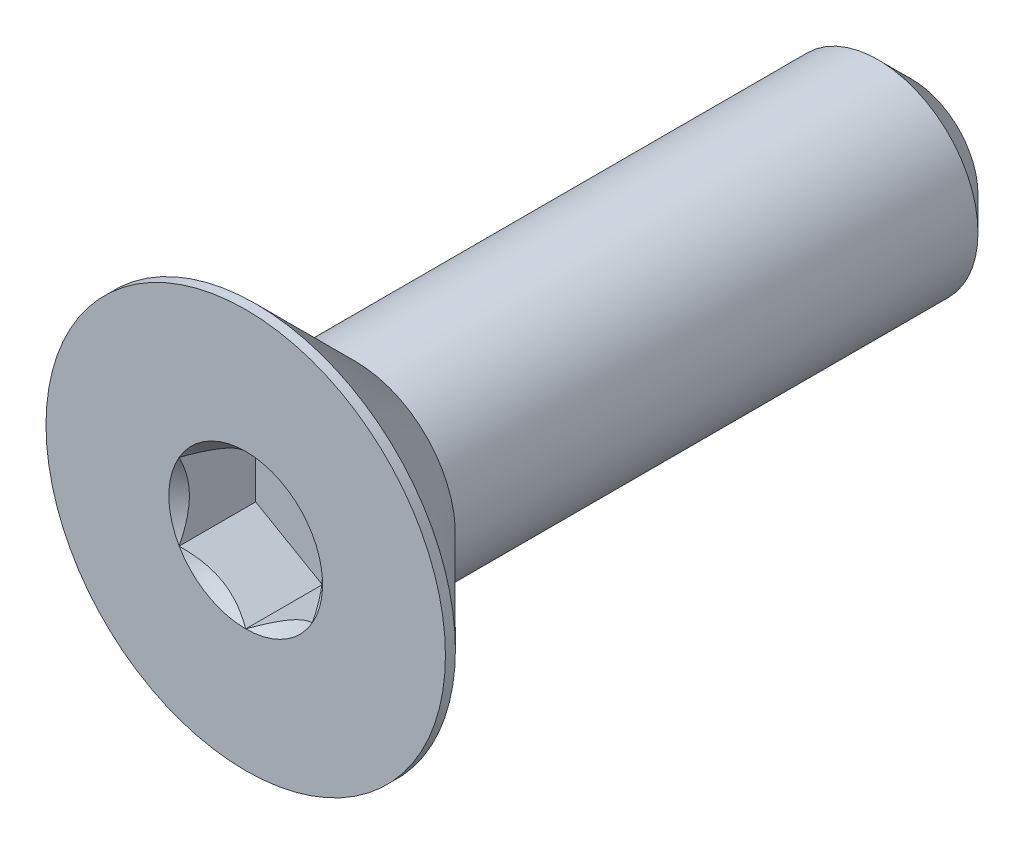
ISO-10303-21;
HEADER;
FILE_DESCRIPTION(('STEP AP214'),'2;1');
FILE_NAME('part.step','',(''),(''),'','','');
FILE_SCHEMA(('AUTOMOTIVE_DESIGN { 1 0 10303 214 1 1 1 1 }'));
ENDSEC;
DATA;
#1=APPLICATION_CONTEXT('core data for automotive mechanical design processes');
#2=APPLICATION_PROTOCOL_DEFINITION('international standard','automotive_design',2000,#1);
#3=PRODUCT_CONTEXT('',#1,'mechanical');
#4=PRODUCT('Part','Part','',(#3));
#5=PRODUCT_RELATED_PRODUCT_CATEGORY('part','',(#4));
#6=PRODUCT_DEFINITION_FORMATION('','',#4);
#7=PRODUCT_DEFINITION_CONTEXT('part definition',#1,'design');
#8=PRODUCT_DEFINITION('design','',#6,#7);
#9=PRODUCT_DEFINITION_SHAPE('','',#8);
#10=(LENGTH_UNIT() NAMED_UNIT(*) SI_UNIT(.MILLI.,.METRE.));
#11=(NAMED_UNIT(*) PLANE_ANGLE_UNIT() SI_UNIT($,.RADIAN.));
#12=(NAMED_UNIT(*) SI_UNIT($,.STERADIAN.) SOLID_ANGLE_UNIT());
#13=UNCERTAINTY_MEASURE_WITH_UNIT(LENGTH_MEASURE(1.E-05),#10,'distance_accuracy_value','');
#14=(GEOMETRIC_REPRESENTATION_CONTEXT(3) GLOBAL_UNCERTAINTY_ASSIGNED_CONTEXT((#13)) GLOBAL_UNIT_ASSIGNED_CONTEXT((#10,
#11,#12)) REPRESENTATION_CONTEXT('',''));
#15=CARTESIAN_POINT('',(0.,0.,0.));
#16=DIRECTION('',(0.,0.,1.));
#17=DIRECTION('',(1.,0.,0.));
#18=AXIS2_PLACEMENT_3D('',#15,#16,#17);
#19=CARTESIAN_POINT('',(0.,0.,-3.300000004));
#20=DIRECTION('',(0.,0.,-1.));
#21=DIRECTION('',(-1.,0.,0.));
#22=AXIS2_PLACEMENT_3D('',#19,#20,#21);
#23=CYLINDRICAL_SURFACE('',#22,2.9999999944);
#24=CARTESIAN_POINT('',(0.,0.,-19.0000000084));
#25=DIRECTION('',(0.,0.,1.));
#26=DIRECTION('',(1.,0.,0.));
#27=AXIS2_PLACEMENT_3D('',#24,#25,#26);
#28=CIRCLE('',#27,2.9999999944);
#29=CARTESIAN_POINT('',(2.9999999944,0.,-19.0000000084));
#30=VERTEX_POINT('',#29);
#31=EDGE_CURVE('E22',#30,#30,#28,.T.);
#32=ORIENTED_EDGE('',*,*,#31,.T.);
#33=EDGE_LOOP('',(#32));
#34=FACE_BOUND('',#33,.T.);
#35=CARTESIAN_POINT('',(0.,0.,-3.30000000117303));
#36=DIRECTION('',(0.,0.,1.));
#37=DIRECTION('',(0.,-1.,0.));
#38=AXIS2_PLACEMENT_3D('',#35,#36,#37);
#39=CIRCLE('',#38,2.99999999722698);
#40=CARTESIAN_POINT('',(0.,-2.99999999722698,-3.30000000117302));
#41=VERTEX_POINT('',#40);
#42=EDGE_CURVE('E112',#41,#41,#39,.F.);
#43=ORIENTED_EDGE('',*,*,#42,.T.);
#44=EDGE_LOOP('',(#43));
#45=FACE_BOUND('',#44,.T.);
#46=ADVANCED_FACE('F14',(#34,#45),#23,.T.);
#47=CARTESIAN_POINT('',(1.9999999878,-1.1547005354,-2.3100000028));
#48=DIRECTION('',(1.,0.,0.));
#49=DIRECTION('',(0.,1.,0.));
#50=AXIS2_PLACEMENT_3D('',#47,#48,#49);
#51=PLANE('',#50);
#52=DIRECTION('',(0.,0.,-1.));
#53=VECTOR('',#52,1.);
#54=CARTESIAN_POINT('',(1.9999999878,1.1547005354,-1.1480700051));
#55=LINE('',#54,#53);
#56=CARTESIAN_POINT('',(1.99999999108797,1.1547005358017,-3.04831647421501E-09));
#57=VERTEX_POINT('',#56);
#58=CARTESIAN_POINT('',(1.9999999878,1.1547005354,-2.3000000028));
#59=VERTEX_POINT('',#58);
#60=EDGE_CURVE('E92',#57,#59,#55,.T.);
#61=ORIENTED_EDGE('',*,*,#60,.T.);
#62=DIRECTION('',(0.,1.,0.));
#63=VECTOR('',#62,1.);
#64=CARTESIAN_POINT('',(1.9999999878,-1.1547005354,-2.3000000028));
#65=LINE('',#64,#63);
#66=CARTESIAN_POINT('',(1.9999999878,-1.1547005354,-2.3000000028));
#67=VERTEX_POINT('',#66);
#68=EDGE_CURVE('E29',#67,#59,#65,.T.);
#69=ORIENTED_EDGE('',*,*,#68,.F.);
#70=DIRECTION('',(0.,0.,1.));
#71=VECTOR('',#70,1.);
#72=CARTESIAN_POINT('',(1.9999999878,-1.1547005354,-1.1480700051));
#73=LINE('',#72,#71);
#74=CARTESIAN_POINT('',(1.99999999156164,-1.15470053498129,-3.04831648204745E-09));
#75=VERTEX_POINT('',#74);
#76=EDGE_CURVE('E111',#67,#75,#73,.T.);
#77=ORIENTED_EDGE('',*,*,#76,.T.);
#78=CARTESIAN_POINT('',(1.9999999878,1.15470053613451,-5.7293805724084E-09));
#79=CARTESIAN_POINT('',(1.99999998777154,1.07584383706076,-0.039391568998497));
#80=CARTESIAN_POINT('',(1.99999998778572,0.995677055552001,-0.0764830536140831));
#81=CARTESIAN_POINT('',(1.99999998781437,0.832178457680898,-0.144472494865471));
#82=CARTESIAN_POINT('',(1.99999998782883,0.7488296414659,-0.175329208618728));
#83=CARTESIAN_POINT('',(1.99999998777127,0.579723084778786,-0.228612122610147));
#84=CARTESIAN_POINT('',(1.99999998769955,0.493974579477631,-0.251066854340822));
#85=CARTESIAN_POINT('',(1.99999998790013,0.320597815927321,-0.28563688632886));
#86=CARTESIAN_POINT('',(1.99999998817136,0.232976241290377,-0.297784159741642));
#87=CARTESIAN_POINT('',(1.99999998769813,0.120862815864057,-0.305898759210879));
#88=CARTESIAN_POINT('',(1.99999998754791,0.0967023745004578,-0.307210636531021));
#89=CARTESIAN_POINT('',(1.99999998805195,0.0483624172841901,-0.308961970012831));
#90=CARTESIAN_POINT('',(1.99999998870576,0.0241829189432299,-0.309401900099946));
#91=CARTESIAN_POINT('',(1.99999998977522,-0.0606943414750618,-0.309399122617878));
#92=CARTESIAN_POINT('',(1.99999998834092,-0.121410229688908,-0.306620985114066));
#93=CARTESIAN_POINT('',(1.99999998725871,-0.242368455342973,-0.295673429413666));
#94=CARTESIAN_POINT('',(1.99999998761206,-0.302610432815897,-0.287500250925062));
#95=CARTESIAN_POINT('',(1.99999998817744,-0.482533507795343,-0.255399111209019));
#96=CARTESIAN_POINT('',(1.99999998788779,-0.600903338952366,-0.223894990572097));
#97=CARTESIAN_POINT('',(1.99999998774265,-0.792109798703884,-0.159445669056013));
#98=CARTESIAN_POINT('',(1.99999998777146,-0.866504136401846,-0.130787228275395));
#99=CARTESIAN_POINT('',(1.99999998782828,-1.01247590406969,-0.068675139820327));
#100=CARTESIAN_POINT('',(1.9999999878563,-1.08407287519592,-0.0352677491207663));
#101=CARTESIAN_POINT('',(1.9999999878,-1.15470053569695,-5.9481570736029E-09));
#102=B_SPLINE_CURVE_WITH_KNOTS('',3,(#78,#79,#80,#81,#82,#83,#84,#85,#86,#87,#88,#89,#90,#91,
#92,#93,#94,#95,#96,#97,#98,#99,#100,#101),.UNSPECIFIED.,.F.,.F.,(4,2,2,2,2,2,2,2,2,2,2,4),(0.,
0.264626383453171,0.53094975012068,0.796360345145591,1.06094461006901,1.13352180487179,
1.20605954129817,1.38811490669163,1.57029729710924,1.93616710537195,2.17518491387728,
2.41201654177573),.UNSPECIFIED.);
#103=EDGE_CURVE('E37',#57,#75,#102,.T.);
#104=ORIENTED_EDGE('',*,*,#103,.F.);
#105=EDGE_LOOP('',(#61,#69,#77,#104));
#106=FACE_BOUND('',#105,.T.);
#107=ADVANCED_FACE('F210',(#106),#51,.F.);
#108=CARTESIAN_POINT('',(0.,0.,-3.6847226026));
#109=DIRECTION('',(0.,0.,1.));
#110=DIRECTION('',(1.,0.,0.));
#111=AXIS2_PLACEMENT_3D('',#108,#109,#110);
#112=CONICAL_SURFACE('',#111,2.6152773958,0.785398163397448);
#113=ORIENTED_EDGE('',*,*,#42,.F.);
#114=EDGE_LOOP('',(#113));
#115=FACE_BOUND('',#114,.T.);
#116=CARTESIAN_POINT('',(0.,0.,-0.3000000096));
#117=DIRECTION('',(0.,0.,1.));
#118=DIRECTION('',(0.,-1.,0.));
#119=AXIS2_PLACEMENT_3D('',#116,#117,#118);
#120=CIRCLE('',#119,5.9999999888);
#121=CARTESIAN_POINT('',(0.,-5.9999999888,-0.3000000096));
#122=VERTEX_POINT('',#121);
#123=EDGE_CURVE('E257',#122,#122,#120,.F.);
#124=ORIENTED_EDGE('',*,*,#123,.T.);
#125=EDGE_LOOP('',(#124));
#126=FACE_BOUND('',#125,.T.);
#127=ADVANCED_FACE('F216',(#115,#126),#112,.T.);
#128=CARTESIAN_POINT('',(0.,-2.3094010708,-2.3100000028));
#129=DIRECTION('',(0.50000000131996,-0.86602540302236,0.));
#130=DIRECTION('',(0.86602540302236,0.50000000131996,0.));
#131=AXIS2_PLACEMENT_3D('',#128,#129,#130);
#132=PLANE('',#131);
#133=ORIENTED_EDGE('',*,*,#76,.F.);
#134=DIRECTION('',(0.86602540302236,0.50000000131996,0.));
#135=VECTOR('',#134,1.);
#136=CARTESIAN_POINT('',(0.,-2.3094010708,-2.3000000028));
#137=LINE('',#136,#135);
#138=CARTESIAN_POINT('',(0.,-2.3094010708,-2.3000000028));
#139=VERTEX_POINT('',#138);
#140=EDGE_CURVE('E265',#139,#67,#137,.T.);
#141=ORIENTED_EDGE('',*,*,#140,.F.);
#142=DIRECTION('',(0.,0.,1.));
#143=VECTOR('',#142,1.);
#144=CARTESIAN_POINT('',(0.,-2.3094010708,-1.1480700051));
#145=LINE('',#144,#143);
#146=CARTESIAN_POINT('',(-2.94942066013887E-10,-2.30940107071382,-8.61750524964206E-11));
#147=VERTEX_POINT('',#146);
#148=EDGE_CURVE('E94',#139,#147,#145,.T.);
#149=ORIENTED_EDGE('',*,*,#148,.T.);
#150=CARTESIAN_POINT('',(1.99999999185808,-1.15470053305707,-3.75370075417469E-09));
#151=CARTESIAN_POINT('',(1.93125902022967,-1.19438815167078,-0.0396495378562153));
#152=CARTESIAN_POINT('',(1.8613686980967,-1.23473934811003,-0.0769700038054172));
#153=CARTESIAN_POINT('',(1.71885515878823,-1.31701957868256,-0.14530218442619));
#154=CARTESIAN_POINT('',(1.6462183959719,-1.35895643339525,-0.176275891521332));
#155=CARTESIAN_POINT('',(1.49974992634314,-1.44352004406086,-0.229334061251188));
#156=CARTESIAN_POINT('',(1.4259555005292,-1.4861252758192,-0.251551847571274));
#157=CARTESIAN_POINT('',(1.2767425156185,-1.57227343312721,-0.285782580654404));
#158=CARTESIAN_POINT('',(1.20132851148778,-1.61581372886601,-0.297821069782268));
#159=CARTESIAN_POINT('',(1.07134900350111,-1.69085743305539,-0.308683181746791));
#160=CARTESIAN_POINT('',(1.01695130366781,-1.72226395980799,-0.310290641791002));
#161=CARTESIAN_POINT('',(0.90824490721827,-1.78502562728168,-0.307579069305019));
#162=CARTESIAN_POINT('',(0.85393624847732,-1.81638074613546,-0.303257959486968));
#163=CARTESIAN_POINT('',(0.745831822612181,-1.87879486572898,-0.288935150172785));
#164=CARTESIAN_POINT('',(0.692036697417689,-1.90985349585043,-0.278927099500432));
#165=CARTESIAN_POINT('',(0.585376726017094,-1.97143365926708,-0.253779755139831));
#166=CARTESIAN_POINT('',(0.532511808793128,-2.00195523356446,-0.23864085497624));
#167=CARTESIAN_POINT('',(0.397133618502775,-2.08011586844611,-0.193708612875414));
#168=CARTESIAN_POINT('',(0.315458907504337,-2.12727078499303,-0.160532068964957));
#169=CARTESIAN_POINT('',(0.195362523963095,-2.19660846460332,-0.104527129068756));
#170=CARTESIAN_POINT('',(0.155785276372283,-2.21945839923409,-0.0848498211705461));
#171=CARTESIAN_POINT('',(0.0773635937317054,-2.2647351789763,-0.0437017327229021));
#172=CARTESIAN_POINT('',(0.0385187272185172,-2.28716227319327,-0.0222320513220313));
#173=CARTESIAN_POINT('',(2.98519060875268E-10,-2.30940107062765,-1.7235013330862E-10));
#174=B_SPLINE_CURVE_WITH_KNOTS('',3,(#150,#151,#152,#153,#154,#155,#156,#157,#158,#159,#160,
#161,#162,#163,#164,#165,#166,#167,#168,#169,#170,#171,#172,#173),.UNSPECIFIED.,.F.,.F.,(4,2,2,
2,2,2,2,2,2,2,2,4),(0.,0.266365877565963,0.534283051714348,0.797946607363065,1.0609465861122,
1.24918064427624,1.43748067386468,1.62599141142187,1.81448769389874,2.11378539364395,
2.26302826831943,2.41218028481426),.UNSPECIFIED.);
#175=EDGE_CURVE('E258',#75,#147,#174,.T.);
#176=ORIENTED_EDGE('',*,*,#175,.F.);
#177=EDGE_LOOP('',(#133,#141,#149,#176));
#178=FACE_BOUND('',#177,.T.);
#179=ADVANCED_FACE('F246',(#178),#132,.F.);
#180=CARTESIAN_POINT('',(-1.9999999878,-1.1547005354,-2.3100000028));
#181=DIRECTION('',(-0.50000000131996,-0.86602540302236,0.));
#182=DIRECTION('',(0.86602540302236,-0.50000000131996,0.));
#183=AXIS2_PLACEMENT_3D('',#180,#181,#182);
#184=PLANE('',#183);
#185=ORIENTED_EDGE('',*,*,#148,.F.);
#186=DIRECTION('',(0.866025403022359,-0.50000000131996,0.));
#187=VECTOR('',#186,1.);
#188=CARTESIAN_POINT('',(-1.9999999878,-1.1547005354,-2.3000000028));
#189=LINE('',#188,#187);
#190=CARTESIAN_POINT('',(-1.9999999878,-1.1547005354,-2.3000000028));
#191=VERTEX_POINT('',#190);
#192=EDGE_CURVE('E83',#191,#139,#189,.T.);
#193=ORIENTED_EDGE('',*,*,#192,.F.);
#194=DIRECTION('',(0.,0.,1.));
#195=VECTOR('',#194,1.);
#196=CARTESIAN_POINT('',(-1.9999999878,-1.1547005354,-1.1480700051));
#197=LINE('',#196,#195);
#198=CARTESIAN_POINT('',(-1.99999999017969,-1.15470054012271,-1.67439864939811E-09));
#199=VERTEX_POINT('',#198);
#200=EDGE_CURVE('E82',#191,#199,#197,.T.);
#201=ORIENTED_EDGE('',*,*,#200,.T.);
#202=CARTESIAN_POINT('',(-5.35426552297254E-10,-2.30940107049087,-3.09128858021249E-10));
#203=CARTESIAN_POINT('',(-0.0687409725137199,-2.26971345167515,-0.0396495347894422));
#204=CARTESIAN_POINT('',(-0.13863129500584,-2.22936225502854,-0.076970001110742));
#205=CARTESIAN_POINT('',(-0.281144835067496,-2.14708202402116,-0.145302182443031));
#206=CARTESIAN_POINT('',(-0.353781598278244,-2.10514516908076,-0.176275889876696));
#207=CARTESIAN_POINT('',(-0.50025006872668,-2.02058155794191,-0.229334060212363));
#208=CARTESIAN_POINT('',(-0.574044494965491,-1.97797632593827,-0.251551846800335));
#209=CARTESIAN_POINT('',(-0.723257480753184,-1.89182816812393,-0.285782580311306));
#210=CARTESIAN_POINT('',(-0.798671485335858,-1.84828787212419,-0.297821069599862));
#211=CARTESIAN_POINT('',(-0.928650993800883,-1.77324416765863,-0.308683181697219));
#212=CARTESIAN_POINT('',(-0.983048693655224,-1.74183764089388,-0.31029064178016));
#213=CARTESIAN_POINT('',(-1.0917550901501,-1.67907597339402,-0.307579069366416));
#214=CARTESIAN_POINT('',(-1.14606374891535,-1.64772085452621,-0.303257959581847));
#215=CARTESIAN_POINT('',(-1.25416817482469,-1.58530673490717,-0.288935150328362));
#216=CARTESIAN_POINT('',(-1.30796330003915,-1.55424810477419,-0.278927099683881));
#217=CARTESIAN_POINT('',(-1.41462327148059,-1.49266794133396,-0.253779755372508));
#218=CARTESIAN_POINT('',(-1.46748818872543,-1.46214636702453,-0.238640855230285));
#219=CARTESIAN_POINT('',(-1.60286637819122,-1.38398573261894,-0.193708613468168));
#220=CARTESIAN_POINT('',(-1.68454108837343,-1.33683081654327,-0.160532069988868));
#221=CARTESIAN_POINT('',(-1.80463747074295,-1.26749313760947,-0.104527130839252));
#222=CARTESIAN_POINT('',(-1.84421471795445,-1.2446432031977,-0.0848498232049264));
#223=CARTESIAN_POINT('',(-1.92263639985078,-1.19936642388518,-0.0437017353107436));
#224=CARTESIAN_POINT('',(-1.96148126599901,-1.17693932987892,-0.0222320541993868));
#225=CARTESIAN_POINT('',(-1.99999999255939,-1.15470053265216,-3.34879712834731E-09));
#226=B_SPLINE_CURVE_WITH_KNOTS('',3,(#202,#203,#204,#205,#206,#207,#208,#209,#210,#211,#212,
#213,#214,#215,#216,#217,#218,#219,#220,#221,#222,#223,#224,#225),.UNSPECIFIED.,.F.,.F.,(4,2,2,
2,2,2,2,2,2,2,2,4),(0.,0.266365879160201,0.534283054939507,0.797946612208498,1.06094659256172,
1.24918065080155,1.43748068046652,1.62599141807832,1.81448770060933,2.11378539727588,
2.26302827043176,2.41218028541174),.UNSPECIFIED.);
#227=EDGE_CURVE('E188',#147,#199,#226,.T.);
#228=ORIENTED_EDGE('',*,*,#227,.F.);
#229=EDGE_LOOP('',(#185,#193,#201,#228));
#230=FACE_BOUND('',#229,.T.);
#231=ADVANCED_FACE('F197',(#230),#184,.F.);
#232=CARTESIAN_POINT('',(-1.9999999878,1.1547005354,-2.3100000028));
#233=DIRECTION('',(-1.,0.,0.));
#234=DIRECTION('',(0.,-1.,0.));
#235=AXIS2_PLACEMENT_3D('',#232,#233,#234);
#236=PLANE('',#235);
#237=ORIENTED_EDGE('',*,*,#200,.F.);
#238=DIRECTION('',(0.,-1.,0.));
#239=VECTOR('',#238,1.);
#240=CARTESIAN_POINT('',(-1.9999999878,1.1547005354,-2.3000000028));
#241=LINE('',#240,#239);
#242=CARTESIAN_POINT('',(-1.9999999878,1.1547005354,-2.3000000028));
#243=VERTEX_POINT('',#242);
#244=EDGE_CURVE('E69',#243,#191,#241,.T.);
#245=ORIENTED_EDGE('',*,*,#244,.F.);
#246=DIRECTION('',(0.,0.,1.));
#247=VECTOR('',#246,1.);
#248=CARTESIAN_POINT('',(-1.9999999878,1.1547005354,-1.1480700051));
#249=LINE('',#248,#247);
#250=CARTESIAN_POINT('',(-1.99999999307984,1.15470053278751,-2.83040169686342E-09));
#251=VERTEX_POINT('',#250);
#252=EDGE_CURVE('E80',#243,#251,#249,.T.);
#253=ORIENTED_EDGE('',*,*,#252,.T.);
#254=CARTESIAN_POINT('',(-1.9999999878,-1.15470053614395,-5.72465599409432E-09));
#255=CARTESIAN_POINT('',(-1.9999999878,-1.07532529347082,-0.0396495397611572));
#256=CARTESIAN_POINT('',(-1.9999999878,-0.994622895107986,-0.0769700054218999));
#257=CARTESIAN_POINT('',(-1.9999999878,-0.830062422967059,-0.14530218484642));
#258=CARTESIAN_POINT('',(-1.9999999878,-0.746188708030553,-0.176275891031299));
#259=CARTESIAN_POINT('',(-1.9999999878,-0.577061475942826,-0.229334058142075));
#260=CARTESIAN_POINT('',(-1.9999999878,-0.491851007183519,-0.251551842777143));
#261=CARTESIAN_POINT('',(-1.9999999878,-0.319554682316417,-0.285782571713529));
#262=CARTESIAN_POINT('',(-1.9999999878,-0.232474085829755,-0.297821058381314));
#263=CARTESIAN_POINT('',(-1.9999999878,-0.0823866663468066,-0.308683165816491));
#264=CARTESIAN_POINT('',(-1.9999999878,-0.0195736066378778,-0.310290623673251));
#265=CARTESIAN_POINT('',(-1.9999999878,0.105949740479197,-0.307579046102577));
#266=CARTESIAN_POINT('',(-1.9999999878,0.168659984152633,-0.303257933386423));
#267=CARTESIAN_POINT('',(-1.9999999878,0.293488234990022,-0.288935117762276));
#268=CARTESIAN_POINT('',(-1.9999999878,0.355605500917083,-0.278927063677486));
#269=CARTESIAN_POINT('',(-1.9999999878,0.478765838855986,-0.253779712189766));
#270=CARTESIAN_POINT('',(-1.9999999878,0.539808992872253,-0.238640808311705));
#271=CARTESIAN_POINT('',(-1.9999999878,0.696130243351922,-0.193708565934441));
#272=CARTESIAN_POINT('',(-1.9999999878,0.790440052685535,-0.160532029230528));
#273=CARTESIAN_POINT('',(-1.9999999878,0.929115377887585,-0.104527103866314));
#274=CARTESIAN_POINT('',(-1.9999999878,0.974815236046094,-0.0848498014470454));
#275=CARTESIAN_POINT('',(-1.9999999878,1.06536877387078,-0.0437017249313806));
#276=CARTESIAN_POINT('',(-1.9999999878,1.11022295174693,-0.0222320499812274));
#277=CARTESIAN_POINT('',(-1.9999999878,1.15470053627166,-5.660802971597E-09));
#278=B_SPLINE_CURVE_WITH_KNOTS('',3,(#254,#255,#256,#257,#258,#259,#260,#261,#262,#263,#264,
#265,#266,#267,#268,#269,#270,#271,#272,#273,#274,#275,#276,#277),.UNSPECIFIED.,.F.,.F.,(4,2,2,
2,2,2,2,2,2,2,2,4),(0.,0.266365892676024,0.534283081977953,0.79794665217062,1.06094664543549,
1.24918072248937,1.43748077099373,1.62599152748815,1.81448782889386,2.11378545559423,
2.26302829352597,2.41218027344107),.UNSPECIFIED.);
#279=EDGE_CURVE('E181',#199,#251,#278,.T.);
#280=ORIENTED_EDGE('',*,*,#279,.F.);
#281=EDGE_LOOP('',(#237,#245,#253,#280));
#282=FACE_BOUND('',#281,.T.);
#283=ADVANCED_FACE('F78',(#282),#236,.F.);
#284=CARTESIAN_POINT('',(0.,2.3094010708,-2.3100000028));
#285=DIRECTION('',(-0.50000000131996,0.86602540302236,0.));
#286=DIRECTION('',(-0.86602540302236,-0.50000000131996,0.));
#287=AXIS2_PLACEMENT_3D('',#284,#285,#286);
#288=PLANE('',#287);
#289=ORIENTED_EDGE('',*,*,#252,.F.);
#290=DIRECTION('',(-0.86602540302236,-0.50000000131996,0.));
#291=VECTOR('',#290,1.);
#292=CARTESIAN_POINT('',(0.,2.3094010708,-2.3000000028));
#293=LINE('',#292,#291);
#294=CARTESIAN_POINT('',(0.,2.3094010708,-2.3000000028));
#295=VERTEX_POINT('',#294);
#296=EDGE_CURVE('E66',#295,#243,#293,.T.);
#297=ORIENTED_EDGE('',*,*,#296,.F.);
#298=DIRECTION('',(0.,0.,1.));
#299=VECTOR('',#298,1.);
#300=CARTESIAN_POINT('',(0.,2.3094010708,-1.1480700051));
#301=LINE('',#300,#299);
#302=CARTESIAN_POINT('',(-1.2631064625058E-10,2.30940107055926,-2.40739552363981E-10));
#303=VERTEX_POINT('',#302);
#304=EDGE_CURVE('E90',#295,#303,#301,.T.);
#305=ORIENTED_EDGE('',*,*,#304,.T.);
#306=CARTESIAN_POINT('',(-1.9999999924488,1.15470053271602,-3.41264978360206E-09));
#307=CARTESIAN_POINT('',(-1.93125902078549,1.19438815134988,-0.0396495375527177));
#308=CARTESIAN_POINT('',(-1.8613686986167,1.23473934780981,-0.0769700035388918));
#309=CARTESIAN_POINT('',(-1.71885515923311,1.31701957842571,-0.145302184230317));
#310=CARTESIAN_POINT('',(-1.64621839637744,1.35895643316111,-0.176275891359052));
#311=CARTESIAN_POINT('',(-1.49974992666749,1.44352004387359,-0.229334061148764));
#312=CARTESIAN_POINT('',(-1.42595550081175,1.48612527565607,-0.251551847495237));
#313=CARTESIAN_POINT('',(-1.27674251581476,1.57227343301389,-0.285782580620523));
#314=CARTESIAN_POINT('',(-1.20132851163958,1.61581372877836,-0.297821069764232));
#315=CARTESIAN_POINT('',(-1.07134900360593,1.69085743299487,-0.308683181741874));
#316=CARTESIAN_POINT('',(-1.01695130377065,1.72226395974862,-0.310290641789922));
#317=CARTESIAN_POINT('',(-0.90824490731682,1.78502562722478,-0.307579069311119));
#318=CARTESIAN_POINT('',(-0.853936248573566,1.81638074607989,-0.303257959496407));
#319=CARTESIAN_POINT('',(-0.745831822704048,1.87879486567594,-0.288935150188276));
#320=CARTESIAN_POINT('',(-0.692036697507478,1.90985349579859,-0.278927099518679));
#321=CARTESIAN_POINT('',(-0.585376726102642,1.97143365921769,-0.253779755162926));
#322=CARTESIAN_POINT('',(-0.532511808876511,2.00195523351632,-0.238640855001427));
#323=CARTESIAN_POINT('',(-0.397133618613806,2.08011586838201,-0.193708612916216));
#324=CARTESIAN_POINT('',(-0.315458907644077,2.12727078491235,-0.160532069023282));
#325=CARTESIAN_POINT('',(-0.195362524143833,2.19660846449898,-0.104527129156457));
#326=CARTESIAN_POINT('',(-0.155785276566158,2.21945839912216,-0.0848498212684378));
#327=CARTESIAN_POINT('',(-0.0773635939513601,2.26473517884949,-0.0437017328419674));
#328=CARTESIAN_POINT('',(-0.0385187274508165,2.28716227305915,-0.0222320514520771));
#329=CARTESIAN_POINT('',(-5.43283673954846E-10,2.30940107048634,-3.13664975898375E-10));
#330=B_SPLINE_CURVE_WITH_KNOTS('',3,(#306,#307,#308,#309,#310,#311,#312,#313,#314,#315,#316,
#317,#318,#319,#320,#321,#322,#323,#324,#325,#326,#327,#328,#329),.UNSPECIFIED.,.F.,.F.,(4,2,2,
2,2,2,2,2,2,2,2,4),(0.,0.2663658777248,0.534283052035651,0.7979466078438,1.06094658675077,
1.24918064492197,1.43748067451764,1.62599141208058,1.81448769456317,2.11378539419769,
2.2630282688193,2.41218028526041),.UNSPECIFIED.);
#331=EDGE_CURVE('E88',#251,#303,#330,.T.);
#332=ORIENTED_EDGE('',*,*,#331,.F.);
#333=EDGE_LOOP('',(#289,#297,#305,#332));
#334=FACE_BOUND('',#333,.T.);
#335=ADVANCED_FACE('F86',(#334),#288,.F.);
#336=CARTESIAN_POINT('',(1.9999999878,1.1547005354,-2.3100000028));
#337=DIRECTION('',(0.50000000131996,0.86602540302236,0.));
#338=DIRECTION('',(-0.86602540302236,0.50000000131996,0.));
#339=AXIS2_PLACEMENT_3D('',#336,#337,#338);
#340=PLANE('',#339);
#341=ORIENTED_EDGE('',*,*,#304,.F.);
#342=DIRECTION('',(-0.86602540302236,0.50000000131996,0.));
#343=VECTOR('',#342,1.);
#344=CARTESIAN_POINT('',(1.9999999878,1.1547005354,-2.3000000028));
#345=LINE('',#344,#343);
#346=EDGE_CURVE('E71',#59,#295,#345,.T.);
#347=ORIENTED_EDGE('',*,*,#346,.F.);
#348=ORIENTED_EDGE('',*,*,#60,.F.);
#349=CARTESIAN_POINT('',(2.90662517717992E-10,2.30940107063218,-1.67814069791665E-10));
#350=CARTESIAN_POINT('',(0.068740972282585,2.2697134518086,-0.0396495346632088));
#351=CARTESIAN_POINT('',(0.138631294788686,2.22936225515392,-0.0769700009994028));
#352=CARTESIAN_POINT('',(0.281144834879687,2.14708202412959,-0.145302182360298));
#353=CARTESIAN_POINT('',(0.353781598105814,2.10514516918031,-0.176275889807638));
#354=CARTESIAN_POINT('',(0.500250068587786,2.0205815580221,-0.229334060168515));
#355=CARTESIAN_POINT('',(0.574044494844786,1.97797632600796,-0.251551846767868));
#356=CARTESIAN_POINT('',(0.723257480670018,1.89182816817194,-0.285782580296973));
#357=CARTESIAN_POINT('',(0.798671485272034,1.84828787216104,-0.297821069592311));
#358=CARTESIAN_POINT('',(0.928650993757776,1.77324416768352,-0.308683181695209));
#359=CARTESIAN_POINT('',(0.983048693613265,1.74183764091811,-0.310290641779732));
#360=CARTESIAN_POINT('',(1.09175509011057,1.67907597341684,-0.307579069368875));
#361=CARTESIAN_POINT('',(1.1460637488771,1.64772085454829,-0.30325795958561));
#362=CARTESIAN_POINT('',(1.25416817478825,1.58530673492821,-0.288935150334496));
#363=CARTESIAN_POINT('',(1.30796330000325,1.55424810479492,-0.278927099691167));
#364=CARTESIAN_POINT('',(1.4146232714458,1.49266794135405,-0.253779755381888));
#365=CARTESIAN_POINT('',(1.46748818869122,1.46214636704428,-0.238640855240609));
#366=CARTESIAN_POINT('',(1.60286637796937,1.38398573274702,-0.193708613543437));
#367=CARTESIAN_POINT('',(1.68454108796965,1.33683081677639,-0.160532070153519));
#368=CARTESIAN_POINT('',(1.80463747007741,1.26749313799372,-0.104527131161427));
#369=CARTESIAN_POINT('',(1.84421471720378,1.24464320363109,-0.0848498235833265));
#370=CARTESIAN_POINT('',(1.9226363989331,1.199366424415,-0.0437017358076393));
#371=CARTESIAN_POINT('',(1.96148126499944,1.17693933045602,-0.0222320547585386));
#372=CARTESIAN_POINT('',(1.99999999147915,1.15470053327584,-3.97247712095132E-09));
#373=B_SPLINE_CURVE_WITH_KNOTS('',3,(#349,#350,#351,#352,#353,#354,#355,#356,#357,#358,#359,
#360,#361,#362,#363,#364,#365,#366,#367,#368,#369,#370,#371,#372),.UNSPECIFIED.,.F.,.F.,(4,2,2,
2,2,2,2,2,2,2,2,4),(0.,0.266365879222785,0.534283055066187,0.797946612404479,1.06094659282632,
1.24918065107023,1.43748068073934,1.62599141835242,1.81448770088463,2.11378539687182,
2.26302826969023,2.41218028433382),.UNSPECIFIED.);
#374=EDGE_CURVE('E141',#303,#57,#373,.T.);
#375=ORIENTED_EDGE('',*,*,#374,.F.);
#376=EDGE_LOOP('',(#341,#347,#348,#375));
#377=FACE_BOUND('',#376,.T.);
#378=ADVANCED_FACE('F157',(#377),#340,.F.);
#379=CARTESIAN_POINT('',(0.,0.,-0.3000000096));
#380=DIRECTION('',(0.,0.,1.));
#381=DIRECTION('',(1.,0.,0.));
#382=AXIS2_PLACEMENT_3D('',#379,#380,#381);
#383=CYLINDRICAL_SURFACE('',#382,5.9999999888);
#384=ORIENTED_EDGE('',*,*,#123,.F.);
#385=EDGE_LOOP('',(#384));
#386=FACE_BOUND('',#385,.T.);
#387=CARTESIAN_POINT('',(0.,0.,0.));
#388=DIRECTION('',(0.,0.,1.));
#389=DIRECTION('',(1.,0.,0.));
#390=AXIS2_PLACEMENT_3D('',#387,#388,#389);
#391=CIRCLE('',#390,5.9999999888);
#392=CARTESIAN_POINT('',(5.9999999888,0.,0.));
#393=VERTEX_POINT('',#392);
#394=EDGE_CURVE('E138',#393,#393,#391,.T.);
#395=ORIENTED_EDGE('',*,*,#394,.F.);
#396=EDGE_LOOP('',(#395));
#397=FACE_BOUND('',#396,.T.);
#398=ADVANCED_FACE('F207',(#386,#397),#383,.T.);
#399=CARTESIAN_POINT('',(0.,0.,-0.311413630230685));
#400=DIRECTION('',(0.,0.,1.));
#401=DIRECTION('',(0.,-1.,0.));
#402=AXIS2_PLACEMENT_3D('',#399,#400,#401);
#403=CONICAL_SURFACE('',#402,1.99798746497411,0.78539812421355);
#404=CARTESIAN_POINT('',(0.,0.,0.));
#405=DIRECTION('',(0.,0.,1.));
#406=DIRECTION('',(0.,-1.,0.));
#407=AXIS2_PLACEMENT_3D('',#404,#405,#406);
#408=CIRCLE('',#407,2.3094010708);
#409=EDGE_CURVE('E135',#75,#147,#408,.F.);
#410=ORIENTED_EDGE('',*,*,#409,.F.);
#411=ORIENTED_EDGE('',*,*,#175,.T.);
#412=EDGE_LOOP('',(#410,#411));
#413=FACE_BOUND('',#412,.T.);
#414=ADVANCED_FACE('F235',(#413),#403,.F.);
#415=CARTESIAN_POINT('',(0.,0.,-0.311413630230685));
#416=DIRECTION('',(0.,0.,1.));
#417=DIRECTION('',(0.,-1.,0.));
#418=AXIS2_PLACEMENT_3D('',#415,#416,#417);
#419=CONICAL_SURFACE('',#418,1.99798746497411,0.78539812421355);
#420=CARTESIAN_POINT('',(0.,0.,0.));
#421=DIRECTION('',(0.,0.,1.));
#422=DIRECTION('',(0.,-1.,0.));
#423=AXIS2_PLACEMENT_3D('',#420,#421,#422);
#424=CIRCLE('',#423,2.3094010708);
#425=EDGE_CURVE('E132',#147,#199,#424,.F.);
#426=ORIENTED_EDGE('',*,*,#425,.F.);
#427=ORIENTED_EDGE('',*,*,#227,.T.);
#428=EDGE_LOOP('',(#426,#427));
#429=FACE_BOUND('',#428,.T.);
#430=ADVANCED_FACE('F177',(#429),#419,.F.);
#431=CARTESIAN_POINT('',(0.,0.,-0.311262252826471));
#432=DIRECTION('',(0.,0.,1.));
#433=DIRECTION('',(1.,0.,0.));
#434=AXIS2_PLACEMENT_3D('',#431,#432,#433);
#435=CONICAL_SURFACE('',#434,1.99813881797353,0.785398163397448);
#436=CARTESIAN_POINT('',(0.,0.,0.));
#437=DIRECTION('',(0.,0.,1.));
#438=DIRECTION('',(1.,0.,0.));
#439=AXIS2_PLACEMENT_3D('',#436,#437,#438);
#440=CIRCLE('',#439,2.3094010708);
#441=EDGE_CURVE('E129',#199,#251,#440,.F.);
#442=ORIENTED_EDGE('',*,*,#441,.F.);
#443=ORIENTED_EDGE('',*,*,#279,.T.);
#444=EDGE_LOOP('',(#442,#443));
#445=FACE_BOUND('',#444,.T.);
#446=ADVANCED_FACE('F172',(#445),#435,.F.);
#447=CARTESIAN_POINT('',(0.,0.,-0.311413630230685));
#448=DIRECTION('',(0.,0.,1.));
#449=DIRECTION('',(0.,-1.,0.));
#450=AXIS2_PLACEMENT_3D('',#447,#448,#449);
#451=CONICAL_SURFACE('',#450,1.99798746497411,0.78539812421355);
#452=CARTESIAN_POINT('',(0.,0.,0.));
#453=DIRECTION('',(0.,0.,1.));
#454=DIRECTION('',(0.,-1.,0.));
#455=AXIS2_PLACEMENT_3D('',#452,#453,#454);
#456=CIRCLE('',#455,2.3094010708);
#457=EDGE_CURVE('E123',#251,#303,#456,.F.);
#458=ORIENTED_EDGE('',*,*,#457,.F.);
#459=ORIENTED_EDGE('',*,*,#331,.T.);
#460=EDGE_LOOP('',(#458,#459));
#461=FACE_BOUND('',#460,.T.);
#462=ADVANCED_FACE('F164',(#461),#451,.F.);
#463=CARTESIAN_POINT('',(0.,0.,-0.311413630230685));
#464=DIRECTION('',(0.,0.,1.));
#465=DIRECTION('',(0.,-1.,0.));
#466=AXIS2_PLACEMENT_3D('',#463,#464,#465);
#467=CONICAL_SURFACE('',#466,1.99798746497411,0.78539812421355);
#468=CARTESIAN_POINT('',(0.,0.,0.));
#469=DIRECTION('',(0.,0.,1.));
#470=DIRECTION('',(0.,-1.,0.));
#471=AXIS2_PLACEMENT_3D('',#468,#469,#470);
#472=CIRCLE('',#471,2.3094010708);
#473=EDGE_CURVE('E118',#303,#57,#472,.F.);
#474=ORIENTED_EDGE('',*,*,#473,.F.);
#475=ORIENTED_EDGE('',*,*,#374,.T.);
#476=EDGE_LOOP('',(#474,#475));
#477=FACE_BOUND('',#476,.T.);
#478=ADVANCED_FACE('F159',(#477),#467,.F.);
#479=CARTESIAN_POINT('',(-6.0719999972,6.0719999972,0.));
#480=DIRECTION('',(0.,0.,1.));
#481=DIRECTION('',(0.,-1.,0.));
#482=AXIS2_PLACEMENT_3D('',#479,#480,#481);
#483=PLANE('',#482);
#484=CARTESIAN_POINT('',(0.,0.,0.));
#485=DIRECTION('',(0.,0.,1.));
#486=DIRECTION('',(1.,0.,0.));
#487=AXIS2_PLACEMENT_3D('',#484,#485,#486);
#488=CIRCLE('',#487,2.3094010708);
#489=EDGE_CURVE('E114',#75,#57,#488,.T.);
#490=ORIENTED_EDGE('',*,*,#489,.F.);
#491=ORIENTED_EDGE('',*,*,#409,.T.);
#492=ORIENTED_EDGE('',*,*,#425,.T.);
#493=ORIENTED_EDGE('',*,*,#441,.T.);
#494=ORIENTED_EDGE('',*,*,#457,.T.);
#495=ORIENTED_EDGE('',*,*,#473,.T.);
#496=EDGE_LOOP('',(#490,#491,#492,#493,#494,#495));
#497=FACE_BOUND('',#496,.T.);
#498=ORIENTED_EDGE('',*,*,#394,.T.);
#499=EDGE_LOOP('',(#498));
#500=FACE_BOUND('',#499,.T.);
#501=ADVANCED_FACE('F163',(#497,#500),#483,.T.);
#502=CARTESIAN_POINT('',(0.,0.,-0.3112574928));
#503=DIRECTION('',(0.,0.,1.));
#504=DIRECTION('',(1.,0.,0.));
#505=AXIS2_PLACEMENT_3D('',#502,#503,#504);
#506=CONICAL_SURFACE('',#505,1.9981436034,0.785398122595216);
#507=ORIENTED_EDGE('',*,*,#489,.T.);
#508=ORIENTED_EDGE('',*,*,#103,.T.);
#509=EDGE_LOOP('',(#507,#508));
#510=FACE_BOUND('',#509,.T.);
#511=ADVANCED_FACE('F166',(#510),#506,.F.);
#512=CARTESIAN_POINT('',(0.,0.,-2.3000000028));
#513=DIRECTION('',(0.,0.,1.));
#514=DIRECTION('',(1.,0.,0.));
#515=AXIS2_PLACEMENT_3D('',#512,#513,#514);
#516=PLANE('',#515);
#517=ORIENTED_EDGE('',*,*,#296,.T.);
#518=ORIENTED_EDGE('',*,*,#244,.T.);
#519=ORIENTED_EDGE('',*,*,#192,.T.);
#520=ORIENTED_EDGE('',*,*,#140,.T.);
#521=ORIENTED_EDGE('',*,*,#68,.T.);
#522=ORIENTED_EDGE('',*,*,#346,.T.);
#523=EDGE_LOOP('',(#517,#518,#519,#520,#521,#522));
#524=FACE_BOUND('',#523,.T.);
#525=ADVANCED_FACE('F68',(#524),#516,.T.);
#526=CARTESIAN_POINT('',(0.,0.,-20.0000000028));
#527=DIRECTION('',(0.,0.,1.));
#528=DIRECTION('',(1.,0.,0.));
#529=AXIS2_PLACEMENT_3D('',#526,#527,#528);
#530=PLANE('',#529);
#531=CARTESIAN_POINT('',(0.,0.,-20.0000000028));
#532=DIRECTION('',(0.,0.,1.));
#533=DIRECTION('',(1.,0.,0.));
#534=AXIS2_PLACEMENT_3D('',#531,#532,#533);
#535=CIRCLE('',#534,2.);
#536=CARTESIAN_POINT('',(2.,0.,-20.0000000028));
#537=VERTEX_POINT('',#536);
#538=EDGE_CURVE('E9',#537,#537,#535,.F.);
#539=ORIENTED_EDGE('',*,*,#538,.T.);
#540=EDGE_LOOP('',(#539));
#541=FACE_BOUND('',#540,.T.);
#542=ADVANCED_FACE('F226',(#541),#530,.F.);
#543=CARTESIAN_POINT('',(0.,0.,-19.0000000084));
#544=DIRECTION('',(0.,0.,1.));
#545=DIRECTION('',(1.,0.,0.));
#546=AXIS2_PLACEMENT_3D('',#543,#544,#545);
#547=CONICAL_SURFACE('',#546,2.9999999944,0.785398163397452);
#548=ORIENTED_EDGE('',*,*,#538,.F.);
#549=EDGE_LOOP('',(#548));
#550=FACE_BOUND('',#549,.T.);
#551=ORIENTED_EDGE('',*,*,#31,.F.);
#552=EDGE_LOOP('',(#551));
#553=FACE_BOUND('',#552,.T.);
#554=ADVANCED_FACE('F16',(#550,#553),#547,.T.);
#555=CLOSED_SHELL('',(#46,#107,#127,#179,#231,#283,#335,#378,#398,#414,#430,#446,#462,#478,#501,
#511,#525,#542,#554));
#556=MANIFOLD_SOLID_BREP('B1',#555);
#557=ADVANCED_BREP_SHAPE_REPRESENTATION('',(#18,#556),#14);
#558=SHAPE_DEFINITION_REPRESENTATION(#9,#557);
ENDSEC;
END-ISO-10303-21;
